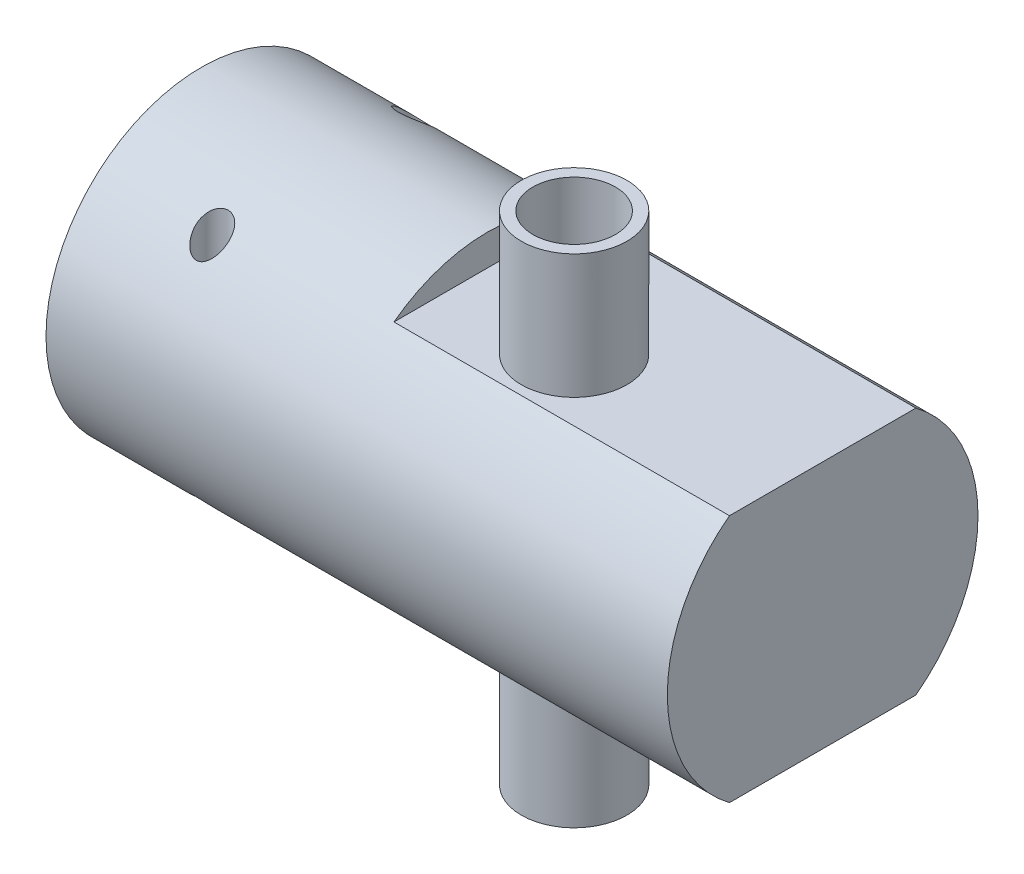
from build123d import *

# Parameters (mm, degrees)
THRUHOLE_DEPTH      = 68.351920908
THRUHOLE_DEPTH_BACK = 68.351920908
SKETCH2_R           = 4.2164
FLATS_DEPTH         = 34.29
TUBE_DEPTH          = 25.4
TUBE_DEPTH_BACK     = 25.4
SKETCH4_R           = 5.3975
SKETCH4_R_2         = 4.2164
SKETCH5_R           = 6.731
TUBECUT_DEPTH       = 61.070463
CHAMFER1_SIZE       = 0.889
EXTRUDE1_DEPTH      = 71.209868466
EXTRUDE1_DEPTH_BACK = 71.209868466
SKETCH7_R           = 1.6256
SKETCH8_W           = 2.3622
SKETCH8_H           = 1.1303


with BuildPart() as part:
    # Sketch1 → Revolve1 (revolve)
    with BuildSketch(Plane.XY, mode=Mode.PRIVATE) as revolve1_sk:
        Polygon((0, 0), (-11.43, 0), (-11.43, 6.7437), (-38.1, 6.7437), (-38.1, 10.3124), (-57.15, 10.3124), (-57.15, 12.7635), (-63.5, 12.7635), (-63.5, 15.875), (0, 15.875), align=None)
    revolve(revolve1_sk.sketch.rotate(Axis((0, 0, 0), (1, 0, 0)), 90), axis=Axis((0, 0, 0), (1, 0, 0)))

    # Sketch2 → ThruHole (cut, two sides: drawn at the far end of the back side and taken through both)
    with BuildSketch(Plane(origin=(0, 0, 0), x_dir=(1, 0, 0), z_dir=(0, 1, 0)).offset(-THRUHOLE_DEPTH_BACK)):
        with Locations(Location((-22.225, -3.175, 0), (0, 0, 270))):
            Circle(SKETCH2_R)
    extrude(amount=THRUHOLE_DEPTH + THRUHOLE_DEPTH_BACK, mode=Mode.SUBTRACT)

    # Sketch3 → Flats (cut)
    with BuildSketch(Plane(origin=(0, 0, 0), x_dir=(0, 0, -1), z_dir=(1, 0, 0))):
        with BuildLine():
            Line((-9.525, 12.7), (9.525, 12.7))
            ThreePointArc((9.525, 12.7), (0, 15.875), (-9.525, 12.7))
        make_face()
        with BuildLine():
            Line((-9.525, -12.7), (9.525, -12.7))
            ThreePointArc((9.525, -12.7), (0, -15.875), (-9.525, -12.7))
        make_face()
    extrude(amount=-FLATS_DEPTH, mode=Mode.SUBTRACT)

    # Sketch4 → Tube (add, two sides: drawn at the far end of the back side and taken through both)
    with BuildSketch(Plane(origin=(0, 0, 0), x_dir=(1, 0, 0), z_dir=(0, 1, 0)).offset(-TUBE_DEPTH_BACK)):
        with Locations(Location((-22.225, -3.175, 0), (0, 0, 270))):
            Circle(SKETCH4_R)
        with Locations(Location((-22.225, -3.175, 0), (0, 0, 270))):
            Circle(SKETCH4_R_2, mode=Mode.SUBTRACT)
    extrude(amount=TUBE_DEPTH + TUBE_DEPTH_BACK)

    # Sketch5 → TubeCut (cut, through all)
    with BuildSketch(Plane.ZY.offset(11.43)):
        Circle(SKETCH5_R)
    extrude(amount=TUBECUT_DEPTH, mode=Mode.SUBTRACT)

    # Chamfer1
    chamfer1_edges = [part.edges().sort_by_distance(p)[0] for p in [
        (-57.15, 0, -10.3124),
    ]]
    chamfer(chamfer1_edges, length=CHAMFER1_SIZE)

    # Sketch7 → Extrude1 (cut, two sides: drawn at the far end of the back side and taken through both)
    with BuildSketch(Plane(origin=(0, 0, 0), x_dir=(1, 0, 0), z_dir=(0, 1, 0)).offset(-EXTRUDE1_DEPTH_BACK)):
        with Locations(Location((-52.07, 10.3124, 0), (0, 0, 270))):
            Circle(SKETCH7_R)
        with Locations(Location((-52.07, -10.3124, 0), (0, 0, 270))):
            Circle(SKETCH7_R)
    extrude(amount=EXTRUDE1_DEPTH + EXTRUDE1_DEPTH_BACK, mode=Mode.SUBTRACT)

    # Sketch8 → Cut-Revolve1 (revolve, cut)
    with BuildSketch(Plane.XY, mode=Mode.PRIVATE) as cut_revolve1_sk:
        with Locations((-31.8389, 7.30885)):
            Rectangle(SKETCH8_W, SKETCH8_H)
    revolve(cut_revolve1_sk.sketch.rotate(Axis((-38.841921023, 0, 0), (1, 0, 0)), 90), axis=Axis((-38.841921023, 0, 0), (1, 0, 0)), mode=Mode.SUBTRACT)


solid = part.part
